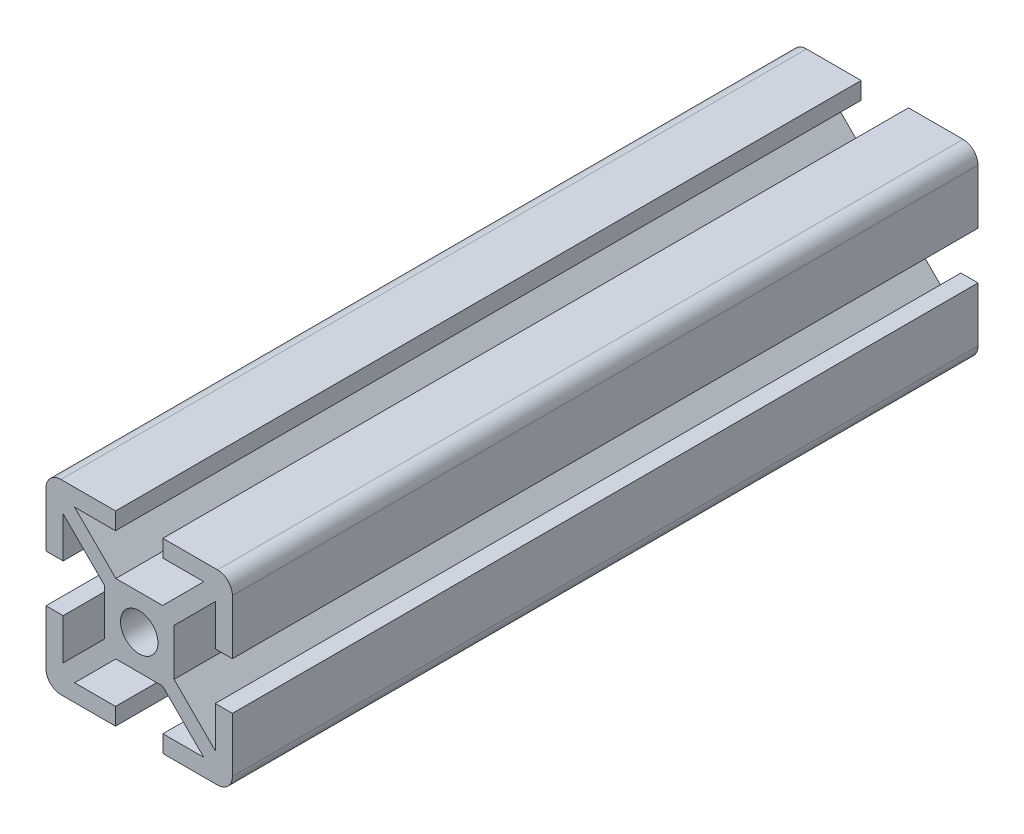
from build123d import *

# Parameters (mm, degrees)
SKETCH1_R      = 2.5527
FINALCUT_DEPTH = 101.6


with BuildPart() as part:
    # Sketch1 → FinalCut (new body)
    with BuildSketch(Plane.XY):
        with BuildLine():
            Line((-4.7498, 0), (-4.7498, 3.187235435))
            Line((-4.7498, 3.187235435), (-10.3632, 8.800635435))
            Line((-10.3632, 8.800635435), (-10.3632, 3.2258))
            Line((-10.3632, 3.2258), (-12.7, 3.2258))
            Line((-12.7, 3.2258), (-12.7, 10.668))
            ThreePointArc((-12.7, 10.668), (-12.104840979, 12.104840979), (-10.668, 12.7))
            Line((-10.668, 12.7), (-3.2258, 12.7))
            Line((-3.2258, 12.7), (-3.2258, 10.3632))
            Line((-3.2258, 10.3632), (-8.800635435, 10.3632))
            Line((-8.800635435, 10.3632), (-3.187235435, 4.7498))
            Line((-3.187235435, 4.7498), (0, 4.7498))
            Line((0, 4.7498), (3.187235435, 4.7498))
            Line((3.187235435, 4.7498), (8.800635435, 10.3632))
            Line((8.800635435, 10.3632), (3.2258, 10.3632))
            Line((3.2258, 10.3632), (3.2258, 12.7))
            Line((3.2258, 12.7), (10.668, 12.7))
            ThreePointArc((10.668, 12.7), (12.104840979, 12.104840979), (12.7, 10.668))
            Line((12.7, 10.668), (12.7, 3.2258))
            Line((12.7, 3.2258), (10.3632, 3.2258))
            Line((10.3632, 3.2258), (10.3632, 8.800635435))
            Line((10.3632, 8.800635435), (4.7498, 3.187235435))
            Line((4.7498, 3.187235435), (4.7498, 0))
            Line((4.7498, 0), (4.7498, -3.187235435))
            Line((4.7498, -3.187235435), (10.3632, -8.800635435))
            Line((10.3632, -8.800635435), (10.3632, -3.2258))
            Line((10.3632, -3.2258), (12.7, -3.2258))
            Line((12.7, -3.2258), (12.7, -10.668))
            ThreePointArc((12.7, -10.668), (12.104840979, -12.104840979), (10.668, -12.7))
            Line((10.668, -12.7), (3.2258, -12.7))
            Line((3.2258, -12.7), (3.2258, -10.3632))
            Line((3.2258, -10.3632), (8.800635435, -10.3632))
            Line((8.800635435, -10.3632), (3.187235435, -4.7498))
            Line((3.187235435, -4.7498), (0, -4.7498))
            Line((0, -4.7498), (-3.187235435, -4.7498))
            Line((-3.187235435, -4.7498), (-8.800635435, -10.3632))
            Line((-8.800635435, -10.3632), (-3.2258, -10.3632))
            Line((-3.2258, -10.3632), (-3.2258, -12.7))
            Line((-3.2258, -12.7), (-10.668, -12.7))
            ThreePointArc((-10.668, -12.7), (-12.104840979, -12.104840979), (-12.7, -10.668))
            Line((-12.7, -10.668), (-12.7, -3.2258))
            Line((-12.7, -3.2258), (-10.3632, -3.2258))
            Line((-10.3632, -3.2258), (-10.3632, -8.800635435))
            Line((-10.3632, -8.800635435), (-4.7498, -3.187235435))
            Line((-4.7498, -3.187235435), (-4.7498, 0))
        make_face()
        Circle(SKETCH1_R, mode=Mode.SUBTRACT)
    extrude(amount=-FINALCUT_DEPTH)


solid = part.part
